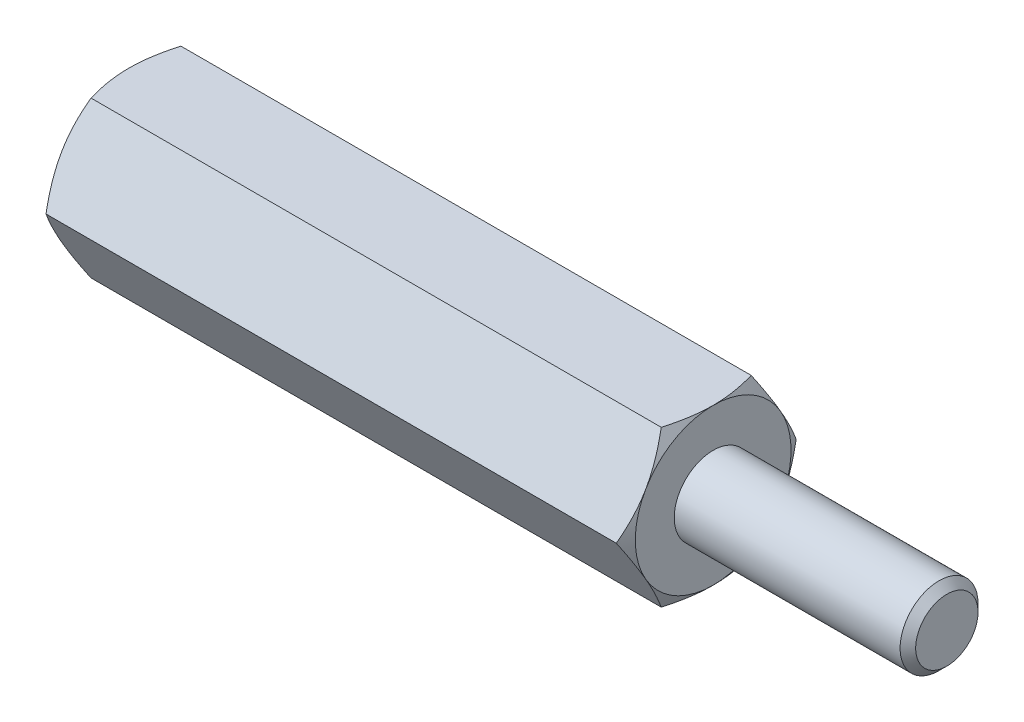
ISO-10303-21;
HEADER;
FILE_DESCRIPTION(('STEP AP214'),'2;1');
FILE_NAME('part.step','',(''),(''),'','','');
FILE_SCHEMA(('AUTOMOTIVE_DESIGN { 1 0 10303 214 1 1 1 1 }'));
ENDSEC;
DATA;
#1=APPLICATION_CONTEXT('core data for automotive mechanical design processes');
#2=APPLICATION_PROTOCOL_DEFINITION('international standard','automotive_design',2000,#1);
#3=PRODUCT_CONTEXT('',#1,'mechanical');
#4=PRODUCT('Part','Part','',(#3));
#5=PRODUCT_RELATED_PRODUCT_CATEGORY('part','',(#4));
#6=PRODUCT_DEFINITION_FORMATION('','',#4);
#7=PRODUCT_DEFINITION_CONTEXT('part definition',#1,'design');
#8=PRODUCT_DEFINITION('design','',#6,#7);
#9=PRODUCT_DEFINITION_SHAPE('','',#8);
#10=(LENGTH_UNIT() NAMED_UNIT(*) SI_UNIT(.MILLI.,.METRE.));
#11=(NAMED_UNIT(*) PLANE_ANGLE_UNIT() SI_UNIT($,.RADIAN.));
#12=(NAMED_UNIT(*) SI_UNIT($,.STERADIAN.) SOLID_ANGLE_UNIT());
#13=UNCERTAINTY_MEASURE_WITH_UNIT(LENGTH_MEASURE(1.E-05),#10,'distance_accuracy_value','');
#14=(GEOMETRIC_REPRESENTATION_CONTEXT(3) GLOBAL_UNCERTAINTY_ASSIGNED_CONTEXT((#13)) GLOBAL_UNIT_ASSIGNED_CONTEXT((#10,
#11,#12)) REPRESENTATION_CONTEXT('',''));
#15=CARTESIAN_POINT('',(0.,0.,0.));
#16=DIRECTION('',(0.,0.,1.));
#17=DIRECTION('',(1.,0.,0.));
#18=AXIS2_PLACEMENT_3D('',#15,#16,#17);
#19=CARTESIAN_POINT('',(7.5,2.,-1.15470053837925));
#20=DIRECTION('',(1.,0.,0.));
#21=DIRECTION('',(0.,0.,-1.));
#22=AXIS2_PLACEMENT_3D('',#19,#20,#21);
#23=PLANE('',#22);
#24=CARTESIAN_POINT('',(7.5,0.,0.));
#25=DIRECTION('',(1.,0.,0.));
#26=DIRECTION('',(0.,0.,-1.));
#27=AXIS2_PLACEMENT_3D('',#24,#25,#26);
#28=CIRCLE('',#27,2.);
#29=CARTESIAN_POINT('',(7.5,-1.,-1.73205080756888));
#30=VERTEX_POINT('',#29);
#31=CARTESIAN_POINT('',(7.5,1.,-1.73205080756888));
#32=VERTEX_POINT('',#31);
#33=EDGE_CURVE('E288',#30,#32,#28,.T.);
#34=ORIENTED_EDGE('',*,*,#33,.T.);
#35=CARTESIAN_POINT('',(7.5,2.,0.));
#36=VERTEX_POINT('',#35);
#37=EDGE_CURVE('E53',#32,#36,#28,.T.);
#38=ORIENTED_EDGE('',*,*,#37,.T.);
#39=CARTESIAN_POINT('',(7.5,1.,1.73205080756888));
#40=VERTEX_POINT('',#39);
#41=EDGE_CURVE('E297',#36,#40,#28,.T.);
#42=ORIENTED_EDGE('',*,*,#41,.T.);
#43=CARTESIAN_POINT('',(7.5,-1.,1.73205080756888));
#44=VERTEX_POINT('',#43);
#45=EDGE_CURVE('E303',#40,#44,#28,.T.);
#46=ORIENTED_EDGE('',*,*,#45,.T.);
#47=CARTESIAN_POINT('',(7.5,0.,0.));
#48=DIRECTION('',(-1.,0.,0.));
#49=DIRECTION('',(0.,-1.,0.));
#50=AXIS2_PLACEMENT_3D('',#47,#48,#49);
#51=CIRCLE('',#50,2.);
#52=CARTESIAN_POINT('',(7.5,-2.,0.));
#53=VERTEX_POINT('',#52);
#54=EDGE_CURVE('E193',#53,#44,#51,.T.);
#55=ORIENTED_EDGE('',*,*,#54,.F.);
#56=EDGE_CURVE('E61',#53,#30,#28,.T.);
#57=ORIENTED_EDGE('',*,*,#56,.T.);
#58=EDGE_LOOP('',(#34,#38,#42,#46,#55,#57));
#59=FACE_BOUND('',#58,.T.);
#60=CARTESIAN_POINT('',(7.5,0.,0.));
#61=DIRECTION('',(1.,0.,0.));
#62=DIRECTION('',(0.,0.,-1.));
#63=AXIS2_PLACEMENT_3D('',#60,#61,#62);
#64=CIRCLE('',#63,1.);
#65=CARTESIAN_POINT('',(7.5,0.,-1.));
#66=VERTEX_POINT('',#65);
#67=EDGE_CURVE('E456',#66,#66,#64,.T.);
#68=ORIENTED_EDGE('',*,*,#67,.F.);
#69=EDGE_LOOP('',(#68));
#70=FACE_BOUND('',#69,.T.);
#71=ADVANCED_FACE('F37',(#59,#70),#23,.T.);
#72=CARTESIAN_POINT('',(7.5,0.,-2.3094010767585));
#73=DIRECTION('',(0.,-0.5,0.866025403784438));
#74=DIRECTION('',(0.,-0.866025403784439,-0.5));
#75=AXIS2_PLACEMENT_3D('',#72,#73,#74);
#76=PLANE('',#75);
#77=CARTESIAN_POINT('',(7.3213005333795,-0.000200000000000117,-2.30951654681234));
#78=CARTESIAN_POINT('',(7.35061046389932,0.0876912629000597,-2.25877250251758));
#79=CARTESIAN_POINT('',(7.37726714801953,0.176341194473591,-2.20759044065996));
#80=CARTESIAN_POINT('',(7.42379750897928,0.355176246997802,-2.10433997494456));
#81=CARTESIAN_POINT('',(7.44365472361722,0.445364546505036,-2.05226973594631));
#82=CARTESIAN_POINT('',(7.47456653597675,0.624623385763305,-1.94877459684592));
#83=CARTESIAN_POINT('',(7.48582684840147,0.713666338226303,-1.89736562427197));
#84=CARTESIAN_POINT('',(7.49927133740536,0.892171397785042,-1.79430568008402));
#85=CARTESIAN_POINT('',(7.50146664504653,0.981632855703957,-1.74265508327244));
#86=CARTESIAN_POINT('',(7.49690901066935,1.1488083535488,-1.64613626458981));
#87=CARTESIAN_POINT('',(7.49127512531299,1.22654737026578,-1.60125362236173));
#88=CARTESIAN_POINT('',(7.47341610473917,1.38151891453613,-1.51178075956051));
#89=CARTESIAN_POINT('',(7.46118486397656,1.4587509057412,-1.46719084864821));
#90=CARTESIAN_POINT('',(7.43060656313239,1.6140421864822,-1.37753338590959));
#91=CARTESIAN_POINT('',(7.41212983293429,1.69208181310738,-1.33247718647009));
#92=CARTESIAN_POINT('',(7.37019448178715,1.84699686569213,-1.24303693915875));
#93=CARTESIAN_POINT('',(7.34674571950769,1.92387427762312,-1.1986517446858));
#94=CARTESIAN_POINT('',(7.3213005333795,2.0002,-1.15458506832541));
#95=B_SPLINE_CURVE_WITH_KNOTS('',3,(#77,#78,#79,#80,#81,#82,#83,#84,#85,#86,#87,#88,#89,#90,#91,
#92,#93,#94),.UNSPECIFIED.,.F.,.F.,(4,2,2,2,2,2,2,2,4),(0.,0.317031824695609,0.634825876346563,
0.944753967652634,1.25430138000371,1.52387047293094,1.79368946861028,2.06949491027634,
2.34475850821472),.UNSPECIFIED.);
#96=CARTESIAN_POINT('',(7.32136720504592,0.,-2.3094010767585));
#97=VERTEX_POINT('',#96);
#98=EDGE_CURVE('E340',#97,#32,#95,.T.);
#99=ORIENTED_EDGE('',*,*,#98,.F.);
#100=DIRECTION('',(-1.,0.,0.));
#101=VECTOR('',#100,1.);
#102=CARTESIAN_POINT('',(7.5,0.,-2.3094010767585));
#103=LINE('',#102,#101);
#104=CARTESIAN_POINT('',(-7.32136720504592,0.,-2.3094010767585));
#105=VERTEX_POINT('',#104);
#106=EDGE_CURVE('E264',#97,#105,#103,.T.);
#107=ORIENTED_EDGE('',*,*,#106,.T.);
#108=CARTESIAN_POINT('',(-7.3213005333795,2.0002,-1.15458506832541));
#109=CARTESIAN_POINT('',(-7.35061046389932,1.91230873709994,-1.20532911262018));
#110=CARTESIAN_POINT('',(-7.37726714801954,1.82365880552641,-1.2565111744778));
#111=CARTESIAN_POINT('',(-7.42379750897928,1.6448237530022,-1.35976164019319));
#112=CARTESIAN_POINT('',(-7.44365472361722,1.55463545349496,-1.41183187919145));
#113=CARTESIAN_POINT('',(-7.47456653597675,1.37537661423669,-1.51532701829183));
#114=CARTESIAN_POINT('',(-7.48582684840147,1.2863336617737,-1.56673599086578));
#115=CARTESIAN_POINT('',(-7.49927133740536,1.10782860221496,-1.66979593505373));
#116=CARTESIAN_POINT('',(-7.50146664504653,1.01836714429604,-1.72144653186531));
#117=CARTESIAN_POINT('',(-7.49690901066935,0.851191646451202,-1.81796535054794));
#118=CARTESIAN_POINT('',(-7.49127512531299,0.773452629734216,-1.86284799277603));
#119=CARTESIAN_POINT('',(-7.47341610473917,0.618481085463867,-1.95232085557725));
#120=CARTESIAN_POINT('',(-7.46118486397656,0.541249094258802,-1.99691076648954));
#121=CARTESIAN_POINT('',(-7.43060656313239,0.385957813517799,-2.08656822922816));
#122=CARTESIAN_POINT('',(-7.41212983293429,0.307918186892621,-2.13162442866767));
#123=CARTESIAN_POINT('',(-7.37019448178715,0.153003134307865,-2.221064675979));
#124=CARTESIAN_POINT('',(-7.34674571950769,0.0761257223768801,-2.26544987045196));
#125=CARTESIAN_POINT('',(-7.3213005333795,-0.000199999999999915,-2.30951654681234));
#126=B_SPLINE_CURVE_WITH_KNOTS('',3,(#108,#109,#110,#111,#112,#113,#114,#115,#116,#117,#118,
#119,#120,#121,#122,#123,#124,#125),.UNSPECIFIED.,.F.,.F.,(4,2,2,2,2,2,2,2,4),(0.,
0.31703182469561,0.634825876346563,0.944753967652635,1.25430138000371,1.52387047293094,
1.79368946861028,2.06949491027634,2.34475850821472),.UNSPECIFIED.);
#127=CARTESIAN_POINT('',(-7.5,1.,-1.73205080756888));
#128=VERTEX_POINT('',#127);
#129=EDGE_CURVE('E379',#128,#105,#126,.T.);
#130=ORIENTED_EDGE('',*,*,#129,.F.);
#131=CARTESIAN_POINT('',(-7.32136720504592,2.,-1.15470053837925));
#132=VERTEX_POINT('',#131);
#133=EDGE_CURVE('E375',#132,#128,#126,.T.);
#134=ORIENTED_EDGE('',*,*,#133,.F.);
#135=DIRECTION('',(-1.,0.,0.));
#136=VECTOR('',#135,1.);
#137=CARTESIAN_POINT('',(7.5,2.,-1.15470053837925));
#138=LINE('',#137,#136);
#139=CARTESIAN_POINT('',(7.321367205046,2.,-1.15470053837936));
#140=VERTEX_POINT('',#139);
#141=EDGE_CURVE('E279',#140,#132,#138,.T.);
#142=ORIENTED_EDGE('',*,*,#141,.F.);
#143=EDGE_CURVE('E229',#32,#140,#95,.T.);
#144=ORIENTED_EDGE('',*,*,#143,.F.);
#145=EDGE_LOOP('',(#99,#107,#130,#134,#142,#144));
#146=FACE_BOUND('',#145,.T.);
#147=ADVANCED_FACE('F148',(#146),#76,.F.);
#148=CARTESIAN_POINT('',(7.5,2.,-1.15470053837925));
#149=DIRECTION('',(0.,-1.,0.));
#150=DIRECTION('',(0.,0.,-1.));
#151=AXIS2_PLACEMENT_3D('',#148,#149,#150);
#152=PLANE('',#151);
#153=CARTESIAN_POINT('',(6.5041453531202,2.,-3.14239762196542));
#154=CARTESIAN_POINT('',(6.54685680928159,2.,-3.05468337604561));
#155=CARTESIAN_POINT('',(6.58917030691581,2.,-2.96677207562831));
#156=CARTESIAN_POINT('',(6.67277831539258,2.,-2.79045070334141));
#157=CARTESIAN_POINT('',(6.71407267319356,2.,-2.70204055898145));
#158=CARTESIAN_POINT('',(6.79561838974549,2.,-2.52418069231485));
#159=CARTESIAN_POINT('',(6.83586319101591,2.,-2.43472795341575));
#160=CARTESIAN_POINT('',(6.91475904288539,2.,-2.25512498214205));
#161=CARTESIAN_POINT('',(6.95341016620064,2.,-2.16497478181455));
#162=CARTESIAN_POINT('',(7.02996617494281,2.,-1.98078525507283));
#163=CARTESIAN_POINT('',(7.06780217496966,2.,-1.88671714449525));
#164=CARTESIAN_POINT('',(7.14070044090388,2.,-1.69751412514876));
#165=CARTESIAN_POINT('',(7.17576294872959,2.,-1.60237931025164));
#166=CARTESIAN_POINT('',(7.24223535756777,2.,-1.41102905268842));
#167=CARTESIAN_POINT('',(7.27365196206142,2.,-1.31481596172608));
#168=CARTESIAN_POINT('',(7.33184764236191,2.,-1.12101028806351));
#169=CARTESIAN_POINT('',(7.3586281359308,2.,-1.02341813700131));
#170=CARTESIAN_POINT('',(7.40615162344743,2.,-0.827336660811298));
#171=CARTESIAN_POINT('',(7.4269281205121,2.,-0.728855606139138));
#172=CARTESIAN_POINT('',(7.46129559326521,2.,-0.530628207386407));
#173=CARTESIAN_POINT('',(7.47488733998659,2.,-0.430882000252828));
#174=CARTESIAN_POINT('',(7.49362159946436,2.,-0.231937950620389));
#175=CARTESIAN_POINT('',(7.49887592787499,2.,-0.132750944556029));
#176=CARTESIAN_POINT('',(7.50079968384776,2.,0.0657049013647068));
#177=CARTESIAN_POINT('',(7.4974689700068,2.,0.164973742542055));
#178=CARTESIAN_POINT('',(7.47965125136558,2.,0.400692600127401));
#179=CARTESIAN_POINT('',(7.46138848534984,2.,0.53685971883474));
#180=CARTESIAN_POINT('',(7.41179958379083,2.,0.806792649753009));
#181=CARTESIAN_POINT('',(7.38046153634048,2.,0.940556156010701));
#182=CARTESIAN_POINT('',(7.30733694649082,2.,1.20849227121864));
#183=CARTESIAN_POINT('',(7.26532316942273,2.,1.34260127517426));
#184=CARTESIAN_POINT('',(7.19701155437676,2.,1.54188460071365));
#185=CARTESIAN_POINT('',(7.17336125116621,2.,1.6079939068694));
#186=CARTESIAN_POINT('',(7.12457310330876,2.,1.73966131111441));
#187=CARTESIAN_POINT('',(7.09943529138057,2.,1.80521942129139));
#188=CARTESIAN_POINT('',(7.03045244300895,2.,1.98014362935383));
#189=CARTESIAN_POINT('',(6.98548288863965,2.,2.08906517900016));
#190=CARTESIAN_POINT('',(6.89293953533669,2.,2.3058004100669));
#191=CARTESIAN_POINT('',(6.84536546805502,2.,2.41361397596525));
#192=CARTESIAN_POINT('',(6.74822629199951,2.,2.62838132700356));
#193=CARTESIAN_POINT('',(6.69866051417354,2.,2.7353348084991));
#194=CARTESIAN_POINT('',(6.59800140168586,2.,2.94852186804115));
#195=CARTESIAN_POINT('',(6.54690802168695,2.,3.05475542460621));
#196=CARTESIAN_POINT('',(6.39169615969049,2.,3.37291303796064));
#197=CARTESIAN_POINT('',(6.28579652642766,2.,3.58396705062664));
#198=CARTESIAN_POINT('',(6.07100981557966,2.,4.00448363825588));
#199=CARTESIAN_POINT('',(5.96212334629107,2.,4.21394652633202));
#200=CARTESIAN_POINT('',(5.75376773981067,2.,4.61000648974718));
#201=CARTESIAN_POINT('',(5.65450073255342,2.,4.79671008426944));
#202=CARTESIAN_POINT('',(5.45476413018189,2.,5.16948614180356));
#203=CARTESIAN_POINT('',(5.35429446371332,2.,5.35555856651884));
#204=CARTESIAN_POINT('',(5.1527937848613,2.,5.72660635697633));
#205=CARTESIAN_POINT('',(5.05176570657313,2.,5.91158331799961));
#206=CARTESIAN_POINT('',(4.84902395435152,2.,6.28114276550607));
#207=CARTESIAN_POINT('',(4.74731033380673,2.,6.46572528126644));
#208=CARTESIAN_POINT('',(4.64534707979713,2.,6.65016883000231));
#209=B_SPLINE_CURVE_WITH_KNOTS('',3,(#153,#154,#155,#156,#157,#158,#159,#160,#161,#162,#163,
#164,#165,#166,#167,#168,#169,#170,#171,#172,#173,#174,#175,#176,#177,#178,#179,#180,#181,#182,
#183,#184,#185,#186,#187,#188,#189,#190,#191,#192,#193,#194,#195,#196,#197,#198,#199,#200,#201,
#202,#203,#204,#205,#206,#207,#208),.UNSPECIFIED.,.F.,.F.,(4,2,2,2,2,2,2,2,2,2,2,2,2,2,2,2,2,2,
2,2,2,2,2,2,2,2,2,4),(0.,0.292684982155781,0.585413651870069,0.879667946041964,1.17390879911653,
1.47805164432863,1.78216793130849,2.08571589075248,2.38917085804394,2.690898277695,
2.99259331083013,3.29020694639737,3.58782548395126,3.99913738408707,4.41082482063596,
4.8321411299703,5.0427662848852,5.25338680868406,5.6068563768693,5.96036243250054,
6.31398824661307,6.66762456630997,7.37597688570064,8.08418599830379,8.71853756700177,
9.3529269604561,9.98522933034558,10.6174830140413),.UNSPECIFIED.);
#210=EDGE_CURVE('E227',#140,#36,#209,.T.);
#211=ORIENTED_EDGE('',*,*,#210,.F.);
#212=ORIENTED_EDGE('',*,*,#141,.T.);
#213=CARTESIAN_POINT('',(-6.5041453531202,2.,-3.14239762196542));
#214=CARTESIAN_POINT('',(-6.54685680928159,2.,-3.05468337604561));
#215=CARTESIAN_POINT('',(-6.58917030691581,2.,-2.96677207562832));
#216=CARTESIAN_POINT('',(-6.67277831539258,2.,-2.79045070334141));
#217=CARTESIAN_POINT('',(-6.71407267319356,2.,-2.70204055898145));
#218=CARTESIAN_POINT('',(-6.79561838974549,2.,-2.52418069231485));
#219=CARTESIAN_POINT('',(-6.83586319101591,2.,-2.43472795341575));
#220=CARTESIAN_POINT('',(-6.91475904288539,2.,-2.25512498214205));
#221=CARTESIAN_POINT('',(-6.95341016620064,2.,-2.16497478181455));
#222=CARTESIAN_POINT('',(-7.02996617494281,2.,-1.98078525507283));
#223=CARTESIAN_POINT('',(-7.06780217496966,2.,-1.88671714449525));
#224=CARTESIAN_POINT('',(-7.14070044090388,2.,-1.69751412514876));
#225=CARTESIAN_POINT('',(-7.17576294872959,2.,-1.60237931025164));
#226=CARTESIAN_POINT('',(-7.24223535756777,2.,-1.41102905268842));
#227=CARTESIAN_POINT('',(-7.27365196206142,2.,-1.31481596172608));
#228=CARTESIAN_POINT('',(-7.33184764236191,2.,-1.12101028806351));
#229=CARTESIAN_POINT('',(-7.3586281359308,2.,-1.02341813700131));
#230=CARTESIAN_POINT('',(-7.40615162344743,2.,-0.827336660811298));
#231=CARTESIAN_POINT('',(-7.4269281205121,2.,-0.728855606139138));
#232=CARTESIAN_POINT('',(-7.46129559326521,2.,-0.530628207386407));
#233=CARTESIAN_POINT('',(-7.47488733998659,2.,-0.430882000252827));
#234=CARTESIAN_POINT('',(-7.49362159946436,2.,-0.231937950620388));
#235=CARTESIAN_POINT('',(-7.49887592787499,2.,-0.132750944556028));
#236=CARTESIAN_POINT('',(-7.50079968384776,2.,0.0657049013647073));
#237=CARTESIAN_POINT('',(-7.4974689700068,2.,0.164973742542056));
#238=CARTESIAN_POINT('',(-7.47965125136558,2.,0.400692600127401));
#239=CARTESIAN_POINT('',(-7.46138848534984,2.,0.53685971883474));
#240=CARTESIAN_POINT('',(-7.41179958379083,2.,0.806792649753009));
#241=CARTESIAN_POINT('',(-7.38046153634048,2.,0.940556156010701));
#242=CARTESIAN_POINT('',(-7.30733694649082,2.,1.20849227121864));
#243=CARTESIAN_POINT('',(-7.26532316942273,2.,1.34260127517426));
#244=CARTESIAN_POINT('',(-7.19701155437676,2.,1.54188460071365));
#245=CARTESIAN_POINT('',(-7.17336125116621,2.,1.6079939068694));
#246=CARTESIAN_POINT('',(-7.12457310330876,2.,1.73966131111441));
#247=CARTESIAN_POINT('',(-7.09943529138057,2.,1.80521942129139));
#248=CARTESIAN_POINT('',(-7.03045244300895,2.,1.98014362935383));
#249=CARTESIAN_POINT('',(-6.98548288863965,2.,2.08906517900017));
#250=CARTESIAN_POINT('',(-6.89293953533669,2.,2.3058004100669));
#251=CARTESIAN_POINT('',(-6.84536546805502,2.,2.41361397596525));
#252=CARTESIAN_POINT('',(-6.74822629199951,2.,2.62838132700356));
#253=CARTESIAN_POINT('',(-6.69866051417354,2.,2.7353348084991));
#254=CARTESIAN_POINT('',(-6.59800140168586,2.,2.94852186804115));
#255=CARTESIAN_POINT('',(-6.54690802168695,2.,3.05475542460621));
#256=CARTESIAN_POINT('',(-6.39169615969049,2.,3.37291303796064));
#257=CARTESIAN_POINT('',(-6.28579652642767,2.,3.58396705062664));
#258=CARTESIAN_POINT('',(-6.07100981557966,2.,4.00448363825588));
#259=CARTESIAN_POINT('',(-5.96212334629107,2.,4.21394652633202));
#260=CARTESIAN_POINT('',(-5.75376773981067,2.,4.61000648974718));
#261=CARTESIAN_POINT('',(-5.65450073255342,2.,4.79671008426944));
#262=CARTESIAN_POINT('',(-5.45476413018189,2.,5.16948614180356));
#263=CARTESIAN_POINT('',(-5.35429446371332,2.,5.35555856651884));
#264=CARTESIAN_POINT('',(-5.1527937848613,2.,5.72660635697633));
#265=CARTESIAN_POINT('',(-5.05176570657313,2.,5.9115833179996));
#266=CARTESIAN_POINT('',(-4.84902395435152,2.,6.28114276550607));
#267=CARTESIAN_POINT('',(-4.74731033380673,2.,6.46572528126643));
#268=CARTESIAN_POINT('',(-4.64534707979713,2.,6.65016883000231));
#269=B_SPLINE_CURVE_WITH_KNOTS('',3,(#213,#214,#215,#216,#217,#218,#219,#220,#221,#222,#223,
#224,#225,#226,#227,#228,#229,#230,#231,#232,#233,#234,#235,#236,#237,#238,#239,#240,#241,#242,
#243,#244,#245,#246,#247,#248,#249,#250,#251,#252,#253,#254,#255,#256,#257,#258,#259,#260,#261,
#262,#263,#264,#265,#266,#267,#268),.UNSPECIFIED.,.F.,.F.,(4,2,2,2,2,2,2,2,2,2,2,2,2,2,2,2,2,2,
2,2,2,2,2,2,2,2,2,4),(0.,0.29268498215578,0.585413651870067,0.879667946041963,1.17390879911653,
1.47805164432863,1.78216793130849,2.08571589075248,2.38917085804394,2.690898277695,
2.99259331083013,3.29020694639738,3.58782548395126,3.99913738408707,4.41082482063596,
4.8321411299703,5.0427662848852,5.25338680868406,5.6068563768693,5.96036243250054,
6.31398824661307,6.66762456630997,7.37597688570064,8.08418599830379,8.71853756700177,
9.3529269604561,9.98522933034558,10.6174830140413),.UNSPECIFIED.);
#270=CARTESIAN_POINT('',(-7.5,2.,0.));
#271=VERTEX_POINT('',#270);
#272=EDGE_CURVE('E241',#271,#132,#269,.F.);
#273=ORIENTED_EDGE('',*,*,#272,.F.);
#274=CARTESIAN_POINT('',(-7.32136720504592,2.,1.15470053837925));
#275=VERTEX_POINT('',#274);
#276=EDGE_CURVE('E249',#275,#271,#269,.F.);
#277=ORIENTED_EDGE('',*,*,#276,.F.);
#278=DIRECTION('',(-1.,0.,0.));
#279=VECTOR('',#278,1.);
#280=CARTESIAN_POINT('',(7.5,2.,1.15470053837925));
#281=LINE('',#280,#279);
#282=CARTESIAN_POINT('',(7.32136720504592,2.,1.15470053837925));
#283=VERTEX_POINT('',#282);
#284=EDGE_CURVE('E276',#283,#275,#281,.T.);
#285=ORIENTED_EDGE('',*,*,#284,.F.);
#286=EDGE_CURVE('E221',#36,#283,#209,.T.);
#287=ORIENTED_EDGE('',*,*,#286,.F.);
#288=EDGE_LOOP('',(#211,#212,#273,#277,#285,#287));
#289=FACE_BOUND('',#288,.T.);
#290=ADVANCED_FACE('F153',(#289),#152,.F.);
#291=CARTESIAN_POINT('',(7.5,2.,1.15470053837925));
#292=DIRECTION('',(0.,-0.5,-0.866025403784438));
#293=DIRECTION('',(0.,0.866025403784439,-0.5));
#294=AXIS2_PLACEMENT_3D('',#291,#292,#293);
#295=PLANE('',#294);
#296=CARTESIAN_POINT('',(7.3213005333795,2.0002,1.15458506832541));
#297=CARTESIAN_POINT('',(7.35061046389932,1.91230873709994,1.20532911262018));
#298=CARTESIAN_POINT('',(7.37726714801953,1.82365880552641,1.2565111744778));
#299=CARTESIAN_POINT('',(7.42379750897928,1.6448237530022,1.35976164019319));
#300=CARTESIAN_POINT('',(7.44365472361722,1.55463545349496,1.41183187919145));
#301=CARTESIAN_POINT('',(7.47456653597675,1.37537661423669,1.51532701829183));
#302=CARTESIAN_POINT('',(7.48582684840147,1.2863336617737,1.56673599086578));
#303=CARTESIAN_POINT('',(7.49927133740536,1.10782860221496,1.66979593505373));
#304=CARTESIAN_POINT('',(7.50146664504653,1.01836714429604,1.72144653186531));
#305=CARTESIAN_POINT('',(7.49690901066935,0.851191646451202,1.81796535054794));
#306=CARTESIAN_POINT('',(7.49127512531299,0.773452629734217,1.86284799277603));
#307=CARTESIAN_POINT('',(7.47341610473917,0.618481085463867,1.95232085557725));
#308=CARTESIAN_POINT('',(7.46118486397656,0.541249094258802,1.99691076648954));
#309=CARTESIAN_POINT('',(7.43060656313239,0.3859578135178,2.08656822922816));
#310=CARTESIAN_POINT('',(7.41212983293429,0.307918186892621,2.13162442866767));
#311=CARTESIAN_POINT('',(7.37019448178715,0.153003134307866,2.221064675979));
#312=CARTESIAN_POINT('',(7.34674571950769,0.0761257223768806,2.26544987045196));
#313=CARTESIAN_POINT('',(7.3213005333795,-0.000199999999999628,2.30951654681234));
#314=B_SPLINE_CURVE_WITH_KNOTS('',3,(#296,#297,#298,#299,#300,#301,#302,#303,#304,#305,#306,
#307,#308,#309,#310,#311,#312,#313),.UNSPECIFIED.,.F.,.F.,(4,2,2,2,2,2,2,2,4),(0.,
0.31703182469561,0.634825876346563,0.944753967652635,1.25430138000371,1.52387047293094,
1.79368946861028,2.06949491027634,2.34475850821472),.UNSPECIFIED.);
#315=EDGE_CURVE('E228',#283,#40,#314,.T.);
#316=ORIENTED_EDGE('',*,*,#315,.F.);
#317=ORIENTED_EDGE('',*,*,#284,.T.);
#318=CARTESIAN_POINT('',(-7.3213005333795,-0.000199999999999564,2.30951654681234));
#319=CARTESIAN_POINT('',(-7.35061046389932,0.0876912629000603,2.25877250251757));
#320=CARTESIAN_POINT('',(-7.37726714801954,0.176341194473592,2.20759044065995));
#321=CARTESIAN_POINT('',(-7.42379750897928,0.355176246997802,2.10433997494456));
#322=CARTESIAN_POINT('',(-7.44365472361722,0.445364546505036,2.0522697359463));
#323=CARTESIAN_POINT('',(-7.47456653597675,0.624623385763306,1.94877459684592));
#324=CARTESIAN_POINT('',(-7.48582684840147,0.713666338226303,1.89736562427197));
#325=CARTESIAN_POINT('',(-7.49927133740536,0.892171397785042,1.79430568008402));
#326=CARTESIAN_POINT('',(-7.50146664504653,0.981632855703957,1.74265508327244));
#327=CARTESIAN_POINT('',(-7.49690901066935,1.1488083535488,1.64613626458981));
#328=CARTESIAN_POINT('',(-7.49127512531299,1.22654737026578,1.60125362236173));
#329=CARTESIAN_POINT('',(-7.47341610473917,1.38151891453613,1.51178075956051));
#330=CARTESIAN_POINT('',(-7.46118486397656,1.4587509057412,1.46719084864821));
#331=CARTESIAN_POINT('',(-7.43060656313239,1.6140421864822,1.37753338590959));
#332=CARTESIAN_POINT('',(-7.41212983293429,1.69208181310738,1.33247718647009));
#333=CARTESIAN_POINT('',(-7.37019448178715,1.84699686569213,1.24303693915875));
#334=CARTESIAN_POINT('',(-7.34674571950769,1.92387427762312,1.1986517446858));
#335=CARTESIAN_POINT('',(-7.3213005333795,2.0002,1.15458506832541));
#336=B_SPLINE_CURVE_WITH_KNOTS('',3,(#318,#319,#320,#321,#322,#323,#324,#325,#326,#327,#328,
#329,#330,#331,#332,#333,#334,#335),.UNSPECIFIED.,.F.,.F.,(4,2,2,2,2,2,2,2,4),(0.,
0.31703182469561,0.634825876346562,0.944753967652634,1.25430138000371,1.52387047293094,
1.79368946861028,2.06949491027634,2.34475850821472),.UNSPECIFIED.);
#337=CARTESIAN_POINT('',(-7.5,1.,1.73205080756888));
#338=VERTEX_POINT('',#337);
#339=EDGE_CURVE('E255',#338,#275,#336,.T.);
#340=ORIENTED_EDGE('',*,*,#339,.F.);
#341=CARTESIAN_POINT('',(-7.32136720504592,0.,2.3094010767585));
#342=VERTEX_POINT('',#341);
#343=EDGE_CURVE('E262',#342,#338,#336,.T.);
#344=ORIENTED_EDGE('',*,*,#343,.F.);
#345=DIRECTION('',(-1.,0.,0.));
#346=VECTOR('',#345,1.);
#347=CARTESIAN_POINT('',(7.5,0.,2.3094010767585));
#348=LINE('',#347,#346);
#349=CARTESIAN_POINT('',(7.32136720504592,0.,2.3094010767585));
#350=VERTEX_POINT('',#349);
#351=EDGE_CURVE('E273',#350,#342,#348,.T.);
#352=ORIENTED_EDGE('',*,*,#351,.F.);
#353=EDGE_CURVE('E215',#40,#350,#314,.T.);
#354=ORIENTED_EDGE('',*,*,#353,.F.);
#355=EDGE_LOOP('',(#316,#317,#340,#344,#352,#354));
#356=FACE_BOUND('',#355,.T.);
#357=ADVANCED_FACE('F235',(#356),#295,.F.);
#358=CARTESIAN_POINT('',(7.5,0.,2.3094010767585));
#359=DIRECTION('',(0.,0.5,-0.866025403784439));
#360=DIRECTION('',(0.,0.866025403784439,0.5));
#361=AXIS2_PLACEMENT_3D('',#358,#359,#360);
#362=PLANE('',#361);
#363=CARTESIAN_POINT('',(7.3213005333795,0.000200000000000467,2.30951654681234));
#364=CARTESIAN_POINT('',(7.35061046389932,-0.0876912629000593,2.25877250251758));
#365=CARTESIAN_POINT('',(7.37726714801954,-0.17634119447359,2.20759044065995));
#366=CARTESIAN_POINT('',(7.42379750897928,-0.355176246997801,2.10433997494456));
#367=CARTESIAN_POINT('',(7.44365472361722,-0.445364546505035,2.0522697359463));
#368=CARTESIAN_POINT('',(7.47456653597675,-0.624623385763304,1.94877459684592));
#369=CARTESIAN_POINT('',(7.48582684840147,-0.713666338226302,1.89736562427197));
#370=CARTESIAN_POINT('',(7.49927133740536,-0.892171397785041,1.79430568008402));
#371=CARTESIAN_POINT('',(7.50146664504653,-0.981632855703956,1.74265508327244));
#372=CARTESIAN_POINT('',(7.49690901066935,-1.1488083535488,1.64613626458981));
#373=CARTESIAN_POINT('',(7.49127512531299,-1.22654737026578,1.60125362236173));
#374=CARTESIAN_POINT('',(7.47341610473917,-1.38151891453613,1.51178075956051));
#375=CARTESIAN_POINT('',(7.46118486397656,-1.4587509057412,1.46719084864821));
#376=CARTESIAN_POINT('',(7.43060656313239,-1.6140421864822,1.37753338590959));
#377=CARTESIAN_POINT('',(7.41212983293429,-1.69208181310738,1.33247718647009));
#378=CARTESIAN_POINT('',(7.37019448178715,-1.84699686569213,1.24303693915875));
#379=CARTESIAN_POINT('',(7.34674571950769,-1.92387427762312,1.1986517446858));
#380=CARTESIAN_POINT('',(7.3213005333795,-2.0002,1.15458506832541));
#381=B_SPLINE_CURVE_WITH_KNOTS('',3,(#363,#364,#365,#366,#367,#368,#369,#370,#371,#372,#373,
#374,#375,#376,#377,#378,#379,#380),.UNSPECIFIED.,.F.,.F.,(4,2,2,2,2,2,2,2,4),(0.,
0.317031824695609,0.634825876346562,0.944753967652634,1.25430138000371,1.52387047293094,
1.79368946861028,2.06949491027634,2.34475850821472),.UNSPECIFIED.);
#382=EDGE_CURVE('E319',#350,#44,#381,.T.);
#383=ORIENTED_EDGE('',*,*,#382,.F.);
#384=ORIENTED_EDGE('',*,*,#351,.T.);
#385=CARTESIAN_POINT('',(-7.3213005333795,-2.0002,1.15458506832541));
#386=CARTESIAN_POINT('',(-7.35061046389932,-1.91230873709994,1.20532911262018));
#387=CARTESIAN_POINT('',(-7.37726714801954,-1.82365880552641,1.2565111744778));
#388=CARTESIAN_POINT('',(-7.42379750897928,-1.6448237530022,1.35976164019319));
#389=CARTESIAN_POINT('',(-7.44365472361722,-1.55463545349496,1.41183187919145));
#390=CARTESIAN_POINT('',(-7.47456653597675,-1.3753766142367,1.51532701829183));
#391=CARTESIAN_POINT('',(-7.48582684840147,-1.2863336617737,1.56673599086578));
#392=CARTESIAN_POINT('',(-7.49927133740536,-1.10782860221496,1.66979593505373));
#393=CARTESIAN_POINT('',(-7.50146664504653,-1.01836714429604,1.72144653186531));
#394=CARTESIAN_POINT('',(-7.49690901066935,-0.851191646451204,1.81796535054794));
#395=CARTESIAN_POINT('',(-7.49127512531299,-0.773452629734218,1.86284799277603));
#396=CARTESIAN_POINT('',(-7.47341610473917,-0.618481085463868,1.95232085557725));
#397=CARTESIAN_POINT('',(-7.46118486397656,-0.541249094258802,1.99691076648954));
#398=CARTESIAN_POINT('',(-7.43060656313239,-0.3859578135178,2.08656822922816));
#399=CARTESIAN_POINT('',(-7.41212983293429,-0.307918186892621,2.13162442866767));
#400=CARTESIAN_POINT('',(-7.37019448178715,-0.153003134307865,2.221064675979));
#401=CARTESIAN_POINT('',(-7.34674571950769,-0.0761257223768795,2.26544987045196));
#402=CARTESIAN_POINT('',(-7.3213005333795,0.000200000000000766,2.30951654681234));
#403=B_SPLINE_CURVE_WITH_KNOTS('',3,(#385,#386,#387,#388,#389,#390,#391,#392,#393,#394,#395,
#396,#397,#398,#399,#400,#401,#402),.UNSPECIFIED.,.F.,.F.,(4,2,2,2,2,2,2,2,4),(0.,
0.317031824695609,0.634825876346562,0.944753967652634,1.25430138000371,1.52387047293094,
1.79368946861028,2.06949491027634,2.34475850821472),.UNSPECIFIED.);
#404=CARTESIAN_POINT('',(-7.5,-1.,1.73205080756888));
#405=VERTEX_POINT('',#404);
#406=EDGE_CURVE('E263',#405,#342,#403,.T.);
#407=ORIENTED_EDGE('',*,*,#406,.F.);
#408=CARTESIAN_POINT('',(-7.32136720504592,-2.,1.15470053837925));
#409=VERTEX_POINT('',#408);
#410=EDGE_CURVE('E250',#409,#405,#403,.T.);
#411=ORIENTED_EDGE('',*,*,#410,.F.);
#412=DIRECTION('',(-1.,0.,0.));
#413=VECTOR('',#412,1.);
#414=CARTESIAN_POINT('',(7.5,-2.,1.15470053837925));
#415=LINE('',#414,#413);
#416=CARTESIAN_POINT('',(7.32136720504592,-2.,1.15470053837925));
#417=VERTEX_POINT('',#416);
#418=EDGE_CURVE('E270',#417,#409,#415,.T.);
#419=ORIENTED_EDGE('',*,*,#418,.F.);
#420=EDGE_CURVE('E210',#44,#417,#381,.T.);
#421=ORIENTED_EDGE('',*,*,#420,.F.);
#422=EDGE_LOOP('',(#383,#384,#407,#411,#419,#421));
#423=FACE_BOUND('',#422,.T.);
#424=ADVANCED_FACE('F318',(#423),#362,.F.);
#425=CARTESIAN_POINT('',(7.5,-2.,1.15470053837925));
#426=DIRECTION('',(0.,1.,0.));
#427=DIRECTION('',(0.,0.,1.));
#428=AXIS2_PLACEMENT_3D('',#425,#426,#427);
#429=PLANE('',#428);
#430=CARTESIAN_POINT('',(6.5041453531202,-2.,-3.14239762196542));
#431=CARTESIAN_POINT('',(6.54685680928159,-2.,-3.05468337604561));
#432=CARTESIAN_POINT('',(6.58917030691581,-2.,-2.96677207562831));
#433=CARTESIAN_POINT('',(6.67277831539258,-2.,-2.79045070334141));
#434=CARTESIAN_POINT('',(6.71407267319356,-2.,-2.70204055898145));
#435=CARTESIAN_POINT('',(6.79561838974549,-2.,-2.52418069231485));
#436=CARTESIAN_POINT('',(6.83586319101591,-2.,-2.43472795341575));
#437=CARTESIAN_POINT('',(6.91475904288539,-2.,-2.25512498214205));
#438=CARTESIAN_POINT('',(6.95341016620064,-2.,-2.16497478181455));
#439=CARTESIAN_POINT('',(7.02996617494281,-2.,-1.98078525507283));
#440=CARTESIAN_POINT('',(7.06780217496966,-2.,-1.88671714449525));
#441=CARTESIAN_POINT('',(7.14070044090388,-2.,-1.69751412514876));
#442=CARTESIAN_POINT('',(7.17576294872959,-2.,-1.60237931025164));
#443=CARTESIAN_POINT('',(7.24223535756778,-2.,-1.41102905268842));
#444=CARTESIAN_POINT('',(7.27365196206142,-2.,-1.31481596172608));
#445=CARTESIAN_POINT('',(7.33184764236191,-2.,-1.12101028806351));
#446=CARTESIAN_POINT('',(7.3586281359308,-2.,-1.02341813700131));
#447=CARTESIAN_POINT('',(7.40615162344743,-2.,-0.827336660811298));
#448=CARTESIAN_POINT('',(7.4269281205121,-2.,-0.728855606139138));
#449=CARTESIAN_POINT('',(7.46129559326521,-2.,-0.530628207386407));
#450=CARTESIAN_POINT('',(7.47488733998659,-2.,-0.430882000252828));
#451=CARTESIAN_POINT('',(7.49362159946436,-2.,-0.231937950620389));
#452=CARTESIAN_POINT('',(7.49887592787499,-2.,-0.132750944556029));
#453=CARTESIAN_POINT('',(7.50079968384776,-2.,0.0657049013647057));
#454=CARTESIAN_POINT('',(7.4974689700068,-2.,0.164973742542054));
#455=CARTESIAN_POINT('',(7.47965125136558,-2.,0.400692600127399));
#456=CARTESIAN_POINT('',(7.46138848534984,-2.,0.536859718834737));
#457=CARTESIAN_POINT('',(7.41179958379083,-2.,0.806792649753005));
#458=CARTESIAN_POINT('',(7.38046153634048,-2.,0.940556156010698));
#459=CARTESIAN_POINT('',(7.30733694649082,-2.,1.20849227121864));
#460=CARTESIAN_POINT('',(7.26532316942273,-2.,1.34260127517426));
#461=CARTESIAN_POINT('',(7.19701155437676,-2.,1.54188460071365));
#462=CARTESIAN_POINT('',(7.17336125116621,-2.,1.60799390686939));
#463=CARTESIAN_POINT('',(7.12457310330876,-2.,1.7396613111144));
#464=CARTESIAN_POINT('',(7.09943529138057,-2.,1.80521942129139));
#465=CARTESIAN_POINT('',(7.03045244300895,-2.,1.98014362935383));
#466=CARTESIAN_POINT('',(6.98548288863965,-2.,2.08906517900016));
#467=CARTESIAN_POINT('',(6.8929395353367,-2.,2.3058004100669));
#468=CARTESIAN_POINT('',(6.84536546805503,-2.,2.41361397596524));
#469=CARTESIAN_POINT('',(6.74822629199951,-2.,2.62838132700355));
#470=CARTESIAN_POINT('',(6.69866051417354,-2.,2.7353348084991));
#471=CARTESIAN_POINT('',(6.59800140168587,-2.,2.94852186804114));
#472=CARTESIAN_POINT('',(6.54690802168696,-2.,3.05475542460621));
#473=CARTESIAN_POINT('',(6.39169615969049,-2.,3.37291303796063));
#474=CARTESIAN_POINT('',(6.28579652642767,-2.,3.58396705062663));
#475=CARTESIAN_POINT('',(6.07100981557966,-2.,4.00448363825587));
#476=CARTESIAN_POINT('',(5.96212334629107,-2.,4.21394652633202));
#477=CARTESIAN_POINT('',(5.75376773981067,-2.,4.61000648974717));
#478=CARTESIAN_POINT('',(5.65450073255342,-2.,4.79671008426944));
#479=CARTESIAN_POINT('',(5.4547641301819,-2.,5.16948614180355));
#480=CARTESIAN_POINT('',(5.35429446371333,-2.,5.35555856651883));
#481=CARTESIAN_POINT('',(5.1527937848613,-2.,5.72660635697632));
#482=CARTESIAN_POINT('',(5.05176570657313,-2.,5.9115833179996));
#483=CARTESIAN_POINT('',(4.84902395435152,-2.,6.28114276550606));
#484=CARTESIAN_POINT('',(4.74731033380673,-2.,6.46572528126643));
#485=CARTESIAN_POINT('',(4.64534707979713,-2.,6.6501688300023));
#486=B_SPLINE_CURVE_WITH_KNOTS('',3,(#430,#431,#432,#433,#434,#435,#436,#437,#438,#439,#440,
#441,#442,#443,#444,#445,#446,#447,#448,#449,#450,#451,#452,#453,#454,#455,#456,#457,#458,#459,
#460,#461,#462,#463,#464,#465,#466,#467,#468,#469,#470,#471,#472,#473,#474,#475,#476,#477,#478,
#479,#480,#481,#482,#483,#484,#485),.UNSPECIFIED.,.F.,.F.,(4,2,2,2,2,2,2,2,2,2,2,2,2,2,2,2,2,2,
2,2,2,2,2,2,2,2,2,4),(0.,0.292684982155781,0.585413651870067,0.879667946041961,1.17390879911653,
1.47805164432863,1.78216793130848,2.08571589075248,2.38917085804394,2.690898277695,
2.99259331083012,3.29020694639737,3.58782548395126,3.99913738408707,4.41082482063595,
4.83214112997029,5.04276628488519,5.25338680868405,5.60685637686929,5.96036243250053,
6.31398824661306,6.66762456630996,7.37597688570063,8.08418599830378,8.71853756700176,
9.35292696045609,9.98522933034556,10.6174830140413),.UNSPECIFIED.);
#487=EDGE_CURVE('E325',#417,#53,#486,.F.);
#488=ORIENTED_EDGE('',*,*,#487,.F.);
#489=ORIENTED_EDGE('',*,*,#418,.T.);
#490=CARTESIAN_POINT('',(-6.5041453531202,-2.,-3.14239762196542));
#491=CARTESIAN_POINT('',(-6.54685680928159,-2.,-3.05468337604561));
#492=CARTESIAN_POINT('',(-6.58917030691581,-2.,-2.96677207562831));
#493=CARTESIAN_POINT('',(-6.67277831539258,-2.,-2.79045070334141));
#494=CARTESIAN_POINT('',(-6.71407267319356,-2.,-2.70204055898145));
#495=CARTESIAN_POINT('',(-6.79561838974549,-2.,-2.52418069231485));
#496=CARTESIAN_POINT('',(-6.83586319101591,-2.,-2.43472795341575));
#497=CARTESIAN_POINT('',(-6.91475904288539,-2.,-2.25512498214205));
#498=CARTESIAN_POINT('',(-6.95341016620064,-2.,-2.16497478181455));
#499=CARTESIAN_POINT('',(-7.02996617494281,-2.,-1.98078525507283));
#500=CARTESIAN_POINT('',(-7.06780217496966,-2.,-1.88671714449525));
#501=CARTESIAN_POINT('',(-7.14070044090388,-2.,-1.69751412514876));
#502=CARTESIAN_POINT('',(-7.17576294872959,-2.,-1.60237931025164));
#503=CARTESIAN_POINT('',(-7.24223535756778,-2.,-1.41102905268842));
#504=CARTESIAN_POINT('',(-7.27365196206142,-2.,-1.31481596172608));
#505=CARTESIAN_POINT('',(-7.33184764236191,-2.,-1.12101028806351));
#506=CARTESIAN_POINT('',(-7.3586281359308,-2.,-1.02341813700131));
#507=CARTESIAN_POINT('',(-7.40615162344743,-2.,-0.827336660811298));
#508=CARTESIAN_POINT('',(-7.4269281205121,-2.,-0.728855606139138));
#509=CARTESIAN_POINT('',(-7.46129559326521,-2.,-0.530628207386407));
#510=CARTESIAN_POINT('',(-7.47488733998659,-2.,-0.430882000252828));
#511=CARTESIAN_POINT('',(-7.49362159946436,-2.,-0.231937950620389));
#512=CARTESIAN_POINT('',(-7.49887592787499,-2.,-0.132750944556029));
#513=CARTESIAN_POINT('',(-7.50079968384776,-2.,0.0657049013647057));
#514=CARTESIAN_POINT('',(-7.4974689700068,-2.,0.164973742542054));
#515=CARTESIAN_POINT('',(-7.47965125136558,-2.,0.400692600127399));
#516=CARTESIAN_POINT('',(-7.46138848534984,-2.,0.536859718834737));
#517=CARTESIAN_POINT('',(-7.41179958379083,-2.,0.806792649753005));
#518=CARTESIAN_POINT('',(-7.38046153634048,-2.,0.940556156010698));
#519=CARTESIAN_POINT('',(-7.30733694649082,-2.,1.20849227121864));
#520=CARTESIAN_POINT('',(-7.26532316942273,-2.,1.34260127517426));
#521=CARTESIAN_POINT('',(-7.19701155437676,-2.,1.54188460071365));
#522=CARTESIAN_POINT('',(-7.17336125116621,-2.,1.60799390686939));
#523=CARTESIAN_POINT('',(-7.12457310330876,-2.,1.7396613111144));
#524=CARTESIAN_POINT('',(-7.09943529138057,-2.,1.80521942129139));
#525=CARTESIAN_POINT('',(-7.03045244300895,-2.,1.98014362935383));
#526=CARTESIAN_POINT('',(-6.98548288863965,-2.,2.08906517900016));
#527=CARTESIAN_POINT('',(-6.8929395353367,-2.,2.30580041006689));
#528=CARTESIAN_POINT('',(-6.84536546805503,-2.,2.41361397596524));
#529=CARTESIAN_POINT('',(-6.74822629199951,-2.,2.62838132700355));
#530=CARTESIAN_POINT('',(-6.69866051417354,-2.,2.7353348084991));
#531=CARTESIAN_POINT('',(-6.59800140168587,-2.,2.94852186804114));
#532=CARTESIAN_POINT('',(-6.54690802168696,-2.,3.05475542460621));
#533=CARTESIAN_POINT('',(-6.39169615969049,-2.,3.37291303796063));
#534=CARTESIAN_POINT('',(-6.28579652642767,-2.,3.58396705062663));
#535=CARTESIAN_POINT('',(-6.07100981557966,-2.,4.00448363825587));
#536=CARTESIAN_POINT('',(-5.96212334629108,-2.,4.21394652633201));
#537=CARTESIAN_POINT('',(-5.75376773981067,-2.,4.61000648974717));
#538=CARTESIAN_POINT('',(-5.65450073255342,-2.,4.79671008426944));
#539=CARTESIAN_POINT('',(-5.4547641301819,-2.,5.16948614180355));
#540=CARTESIAN_POINT('',(-5.35429446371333,-2.,5.35555856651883));
#541=CARTESIAN_POINT('',(-5.1527937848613,-2.,5.72660635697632));
#542=CARTESIAN_POINT('',(-5.05176570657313,-2.,5.9115833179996));
#543=CARTESIAN_POINT('',(-4.84902395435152,-2.,6.28114276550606));
#544=CARTESIAN_POINT('',(-4.74731033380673,-2.,6.46572528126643));
#545=CARTESIAN_POINT('',(-4.64534707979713,-2.,6.6501688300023));
#546=B_SPLINE_CURVE_WITH_KNOTS('',3,(#490,#491,#492,#493,#494,#495,#496,#497,#498,#499,#500,
#501,#502,#503,#504,#505,#506,#507,#508,#509,#510,#511,#512,#513,#514,#515,#516,#517,#518,#519,
#520,#521,#522,#523,#524,#525,#526,#527,#528,#529,#530,#531,#532,#533,#534,#535,#536,#537,#538,
#539,#540,#541,#542,#543,#544,#545),.UNSPECIFIED.,.F.,.F.,(4,2,2,2,2,2,2,2,2,2,2,2,2,2,2,2,2,2,
2,2,2,2,2,2,2,2,2,4),(0.,0.292684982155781,0.585413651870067,0.879667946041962,1.17390879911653,
1.47805164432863,1.78216793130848,2.08571589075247,2.38917085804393,2.690898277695,
2.99259331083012,3.29020694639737,3.58782548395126,3.99913738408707,4.41082482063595,
4.83214112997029,5.04276628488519,5.25338680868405,5.60685637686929,5.96036243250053,
6.31398824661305,6.66762456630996,7.37597688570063,8.08418599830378,8.71853756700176,
9.35292696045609,9.98522933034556,10.6174830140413),.UNSPECIFIED.);
#547=CARTESIAN_POINT('',(-7.5,-2.,0.));
#548=VERTEX_POINT('',#547);
#549=EDGE_CURVE('E371',#548,#409,#546,.T.);
#550=ORIENTED_EDGE('',*,*,#549,.F.);
#551=CARTESIAN_POINT('',(-7.32136720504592,-2.,-1.15470053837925));
#552=VERTEX_POINT('',#551);
#553=EDGE_CURVE('E376',#552,#548,#546,.T.);
#554=ORIENTED_EDGE('',*,*,#553,.F.);
#555=DIRECTION('',(-1.,0.,0.));
#556=VECTOR('',#555,1.);
#557=CARTESIAN_POINT('',(7.5,-2.,-1.15470053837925));
#558=LINE('',#557,#556);
#559=CARTESIAN_POINT('',(7.32136720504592,-2.,-1.15470053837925));
#560=VERTEX_POINT('',#559);
#561=EDGE_CURVE('E267',#560,#552,#558,.T.);
#562=ORIENTED_EDGE('',*,*,#561,.F.);
#563=EDGE_CURVE('E195',#53,#560,#486,.F.);
#564=ORIENTED_EDGE('',*,*,#563,.F.);
#565=EDGE_LOOP('',(#488,#489,#550,#554,#562,#564));
#566=FACE_BOUND('',#565,.T.);
#567=ADVANCED_FACE('F172',(#566),#429,.F.);
#568=CARTESIAN_POINT('',(7.5,-2.,-1.15470053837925));
#569=DIRECTION('',(0.,0.5,0.866025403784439));
#570=DIRECTION('',(0.,-0.866025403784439,0.5));
#571=AXIS2_PLACEMENT_3D('',#568,#569,#570);
#572=PLANE('',#571);
#573=CARTESIAN_POINT('',(7.3213005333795,-2.0002,-1.15458506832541));
#574=CARTESIAN_POINT('',(7.35061046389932,-1.91230873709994,-1.20532911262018));
#575=CARTESIAN_POINT('',(7.37726714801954,-1.82365880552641,-1.2565111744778));
#576=CARTESIAN_POINT('',(7.42379750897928,-1.6448237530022,-1.35976164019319));
#577=CARTESIAN_POINT('',(7.44365472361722,-1.55463545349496,-1.41183187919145));
#578=CARTESIAN_POINT('',(7.47456653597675,-1.3753766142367,-1.51532701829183));
#579=CARTESIAN_POINT('',(7.48582684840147,-1.2863336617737,-1.56673599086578));
#580=CARTESIAN_POINT('',(7.49927133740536,-1.10782860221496,-1.66979593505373));
#581=CARTESIAN_POINT('',(7.50146664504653,-1.01836714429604,-1.72144653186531));
#582=CARTESIAN_POINT('',(7.49690901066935,-0.851191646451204,-1.81796535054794));
#583=CARTESIAN_POINT('',(7.49127512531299,-0.773452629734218,-1.86284799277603));
#584=CARTESIAN_POINT('',(7.47341610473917,-0.618481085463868,-1.95232085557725));
#585=CARTESIAN_POINT('',(7.46118486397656,-0.541249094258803,-1.99691076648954));
#586=CARTESIAN_POINT('',(7.43060656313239,-0.3859578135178,-2.08656822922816));
#587=CARTESIAN_POINT('',(7.41212983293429,-0.307918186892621,-2.13162442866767));
#588=CARTESIAN_POINT('',(7.37019448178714,-0.153003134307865,-2.221064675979));
#589=CARTESIAN_POINT('',(7.34674571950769,-0.07612572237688,-2.26544987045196));
#590=CARTESIAN_POINT('',(7.3213005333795,0.00020000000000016,-2.30951654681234));
#591=B_SPLINE_CURVE_WITH_KNOTS('',3,(#573,#574,#575,#576,#577,#578,#579,#580,#581,#582,#583,
#584,#585,#586,#587,#588,#589,#590),.UNSPECIFIED.,.F.,.F.,(4,2,2,2,2,2,2,2,4),(0.,
0.317031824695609,0.634825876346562,0.944753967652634,1.25430138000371,1.52387047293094,
1.79368946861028,2.06949491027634,2.34475850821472),.UNSPECIFIED.);
#592=EDGE_CURVE('E192',#560,#30,#591,.T.);
#593=ORIENTED_EDGE('',*,*,#592,.F.);
#594=ORIENTED_EDGE('',*,*,#561,.T.);
#595=CARTESIAN_POINT('',(-7.3213005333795,0.000199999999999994,-2.30951654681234));
#596=CARTESIAN_POINT('',(-7.35061046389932,-0.08769126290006,-2.25877250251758));
#597=CARTESIAN_POINT('',(-7.37726714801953,-0.176341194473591,-2.20759044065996));
#598=CARTESIAN_POINT('',(-7.42379750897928,-0.355176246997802,-2.10433997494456));
#599=CARTESIAN_POINT('',(-7.44365472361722,-0.445364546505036,-2.05226973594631));
#600=CARTESIAN_POINT('',(-7.47456653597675,-0.624623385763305,-1.94877459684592));
#601=CARTESIAN_POINT('',(-7.48582684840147,-0.713666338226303,-1.89736562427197));
#602=CARTESIAN_POINT('',(-7.49927133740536,-0.892171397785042,-1.79430568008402));
#603=CARTESIAN_POINT('',(-7.50146664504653,-0.981632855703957,-1.74265508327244));
#604=CARTESIAN_POINT('',(-7.49690901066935,-1.1488083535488,-1.64613626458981));
#605=CARTESIAN_POINT('',(-7.49127512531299,-1.22654737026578,-1.60125362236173));
#606=CARTESIAN_POINT('',(-7.47341610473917,-1.38151891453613,-1.51178075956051));
#607=CARTESIAN_POINT('',(-7.46118486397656,-1.4587509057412,-1.46719084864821));
#608=CARTESIAN_POINT('',(-7.43060656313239,-1.6140421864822,-1.37753338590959));
#609=CARTESIAN_POINT('',(-7.41212983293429,-1.69208181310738,-1.33247718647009));
#610=CARTESIAN_POINT('',(-7.37019448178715,-1.84699686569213,-1.24303693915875));
#611=CARTESIAN_POINT('',(-7.34674571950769,-1.92387427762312,-1.1986517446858));
#612=CARTESIAN_POINT('',(-7.3213005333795,-2.0002,-1.15458506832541));
#613=B_SPLINE_CURVE_WITH_KNOTS('',3,(#595,#596,#597,#598,#599,#600,#601,#602,#603,#604,#605,
#606,#607,#608,#609,#610,#611,#612),.UNSPECIFIED.,.F.,.F.,(4,2,2,2,2,2,2,2,4),(0.,
0.317031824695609,0.634825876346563,0.944753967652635,1.25430138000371,1.52387047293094,
1.79368946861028,2.06949491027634,2.34475850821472),.UNSPECIFIED.);
#614=CARTESIAN_POINT('',(-7.5,-1.,-1.73205080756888));
#615=VERTEX_POINT('',#614);
#616=EDGE_CURVE('E178',#615,#552,#613,.T.);
#617=ORIENTED_EDGE('',*,*,#616,.F.);
#618=EDGE_CURVE('E383',#105,#615,#613,.T.);
#619=ORIENTED_EDGE('',*,*,#618,.F.);
#620=ORIENTED_EDGE('',*,*,#106,.F.);
#621=EDGE_CURVE('E185',#30,#97,#591,.T.);
#622=ORIENTED_EDGE('',*,*,#621,.F.);
#623=EDGE_LOOP('',(#593,#594,#617,#619,#620,#622));
#624=FACE_BOUND('',#623,.T.);
#625=ADVANCED_FACE('F167',(#624),#572,.F.);
#626=CARTESIAN_POINT('',(-7.5,0.,0.));
#627=DIRECTION('',(1.,0.,0.));
#628=DIRECTION('',(0.,1.,0.));
#629=AXIS2_PLACEMENT_3D('',#626,#627,#628);
#630=CONICAL_SURFACE('',#629,2.,1.0471975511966);
#631=ORIENTED_EDGE('',*,*,#129,.T.);
#632=ORIENTED_EDGE('',*,*,#618,.T.);
#633=CARTESIAN_POINT('',(-7.5,0.,0.));
#634=DIRECTION('',(1.,0.,0.));
#635=DIRECTION('',(0.,0.,-1.));
#636=AXIS2_PLACEMENT_3D('',#633,#634,#635);
#637=CIRCLE('',#636,2.);
#638=EDGE_CURVE('E282',#615,#128,#637,.T.);
#639=ORIENTED_EDGE('',*,*,#638,.T.);
#640=EDGE_LOOP('',(#631,#632,#639));
#641=FACE_BOUND('',#640,.T.);
#642=ADVANCED_FACE('F171',(#641),#630,.T.);
#643=ORIENTED_EDGE('',*,*,#553,.T.);
#644=EDGE_CURVE('E286',#548,#615,#637,.T.);
#645=ORIENTED_EDGE('',*,*,#644,.T.);
#646=ORIENTED_EDGE('',*,*,#616,.T.);
#647=EDGE_LOOP('',(#643,#645,#646));
#648=FACE_BOUND('',#647,.T.);
#649=ADVANCED_FACE('F393',(#648),#630,.T.);
#650=ORIENTED_EDGE('',*,*,#410,.T.);
#651=CARTESIAN_POINT('',(-7.5,0.,0.));
#652=DIRECTION('',(-1.,0.,0.));
#653=DIRECTION('',(0.,-1.,0.));
#654=AXIS2_PLACEMENT_3D('',#651,#652,#653);
#655=CIRCLE('',#654,2.);
#656=EDGE_CURVE('E346',#548,#405,#655,.T.);
#657=ORIENTED_EDGE('',*,*,#656,.F.);
#658=ORIENTED_EDGE('',*,*,#549,.T.);
#659=EDGE_LOOP('',(#650,#657,#658));
#660=FACE_BOUND('',#659,.T.);
#661=ADVANCED_FACE('F488',(#660),#630,.T.);
#662=ORIENTED_EDGE('',*,*,#343,.T.);
#663=EDGE_CURVE('E368',#338,#405,#637,.T.);
#664=ORIENTED_EDGE('',*,*,#663,.T.);
#665=ORIENTED_EDGE('',*,*,#406,.T.);
#666=EDGE_LOOP('',(#662,#664,#665));
#667=FACE_BOUND('',#666,.T.);
#668=ADVANCED_FACE('F158',(#667),#630,.T.);
#669=ORIENTED_EDGE('',*,*,#339,.T.);
#670=ORIENTED_EDGE('',*,*,#276,.T.);
#671=EDGE_CURVE('E614',#271,#338,#637,.T.);
#672=ORIENTED_EDGE('',*,*,#671,.T.);
#673=EDGE_LOOP('',(#669,#670,#672));
#674=FACE_BOUND('',#673,.T.);
#675=ADVANCED_FACE('F486',(#674),#630,.T.);
#676=ORIENTED_EDGE('',*,*,#272,.T.);
#677=ORIENTED_EDGE('',*,*,#133,.T.);
#678=EDGE_CURVE('E287',#128,#271,#637,.T.);
#679=ORIENTED_EDGE('',*,*,#678,.T.);
#680=EDGE_LOOP('',(#676,#677,#679));
#681=FACE_BOUND('',#680,.T.);
#682=ADVANCED_FACE('F165',(#681),#630,.T.);
#683=CARTESIAN_POINT('',(-7.5,2.,-1.15470053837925));
#684=DIRECTION('',(1.,0.,0.));
#685=DIRECTION('',(0.,0.,-1.));
#686=AXIS2_PLACEMENT_3D('',#683,#684,#685);
#687=PLANE('',#686);
#688=CARTESIAN_POINT('',(-7.5,0.,0.));
#689=DIRECTION('',(-1.,0.,0.));
#690=DIRECTION('',(0.,0.,1.));
#691=AXIS2_PLACEMENT_3D('',#688,#689,#690);
#692=CIRCLE('',#691,0.8);
#693=CARTESIAN_POINT('',(-7.5,0.,0.8));
#694=VERTEX_POINT('',#693);
#695=EDGE_CURVE('E460',#694,#694,#692,.T.);
#696=ORIENTED_EDGE('',*,*,#695,.F.);
#697=EDGE_LOOP('',(#696));
#698=FACE_BOUND('',#697,.T.);
#699=ORIENTED_EDGE('',*,*,#678,.F.);
#700=ORIENTED_EDGE('',*,*,#638,.F.);
#701=ORIENTED_EDGE('',*,*,#644,.F.);
#702=ORIENTED_EDGE('',*,*,#656,.T.);
#703=ORIENTED_EDGE('',*,*,#663,.F.);
#704=ORIENTED_EDGE('',*,*,#671,.F.);
#705=EDGE_LOOP('',(#699,#700,#701,#702,#703,#704));
#706=FACE_BOUND('',#705,.T.);
#707=ADVANCED_FACE('F161',(#698,#706),#687,.F.);
#708=CARTESIAN_POINT('',(7.5,0.,0.));
#709=DIRECTION('',(-1.,0.,0.));
#710=DIRECTION('',(0.,1.,0.));
#711=AXIS2_PLACEMENT_3D('',#708,#709,#710);
#712=CONICAL_SURFACE('',#711,2.,1.0471975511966);
#713=ORIENTED_EDGE('',*,*,#98,.T.);
#714=ORIENTED_EDGE('',*,*,#33,.F.);
#715=ORIENTED_EDGE('',*,*,#621,.T.);
#716=EDGE_LOOP('',(#713,#714,#715));
#717=FACE_BOUND('',#716,.T.);
#718=ADVANCED_FACE('F164',(#717),#712,.T.);
#719=ORIENTED_EDGE('',*,*,#563,.T.);
#720=ORIENTED_EDGE('',*,*,#592,.T.);
#721=ORIENTED_EDGE('',*,*,#56,.F.);
#722=EDGE_LOOP('',(#719,#720,#721));
#723=FACE_BOUND('',#722,.T.);
#724=ADVANCED_FACE('F202',(#723),#712,.T.);
#725=ORIENTED_EDGE('',*,*,#420,.T.);
#726=ORIENTED_EDGE('',*,*,#487,.T.);
#727=ORIENTED_EDGE('',*,*,#54,.T.);
#728=EDGE_LOOP('',(#725,#726,#727));
#729=FACE_BOUND('',#728,.T.);
#730=ADVANCED_FACE('F467',(#729),#712,.T.);
#731=ORIENTED_EDGE('',*,*,#353,.T.);
#732=ORIENTED_EDGE('',*,*,#382,.T.);
#733=ORIENTED_EDGE('',*,*,#45,.F.);
#734=EDGE_LOOP('',(#731,#732,#733));
#735=FACE_BOUND('',#734,.T.);
#736=ADVANCED_FACE('F359',(#735),#712,.T.);
#737=ORIENTED_EDGE('',*,*,#286,.T.);
#738=ORIENTED_EDGE('',*,*,#315,.T.);
#739=ORIENTED_EDGE('',*,*,#41,.F.);
#740=EDGE_LOOP('',(#737,#738,#739));
#741=FACE_BOUND('',#740,.T.);
#742=ADVANCED_FACE('F354',(#741),#712,.T.);
#743=ORIENTED_EDGE('',*,*,#143,.T.);
#744=ORIENTED_EDGE('',*,*,#210,.T.);
#745=ORIENTED_EDGE('',*,*,#37,.F.);
#746=EDGE_LOOP('',(#743,#744,#745));
#747=FACE_BOUND('',#746,.T.);
#748=ADVANCED_FACE('F143',(#747),#712,.T.);
#749=CARTESIAN_POINT('',(-1.5,0.,0.));
#750=DIRECTION('',(-1.,0.,0.));
#751=DIRECTION('',(0.,0.,1.));
#752=AXIS2_PLACEMENT_3D('',#749,#750,#751);
#753=CYLINDRICAL_SURFACE('',#752,0.8);
#754=CARTESIAN_POINT('',(-1.5,0.,0.));
#755=DIRECTION('',(1.,0.,0.));
#756=DIRECTION('',(0.,1.,0.));
#757=AXIS2_PLACEMENT_3D('',#754,#755,#756);
#758=CIRCLE('',#757,0.799999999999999);
#759=CARTESIAN_POINT('',(-1.5,0.8,0.));
#760=VERTEX_POINT('',#759);
#761=EDGE_CURVE('E457',#760,#760,#758,.T.);
#762=ORIENTED_EDGE('',*,*,#761,.T.);
#763=EDGE_LOOP('',(#762));
#764=FACE_BOUND('',#763,.T.);
#765=ORIENTED_EDGE('',*,*,#695,.T.);
#766=EDGE_LOOP('',(#765));
#767=FACE_BOUND('',#766,.T.);
#768=ADVANCED_FACE('F133',(#764,#767),#753,.F.);
#769=CARTESIAN_POINT('',(-1.03811978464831,0.,0.));
#770=DIRECTION('',(-1.,0.,0.));
#771=DIRECTION('',(0.,-1.,0.));
#772=AXIS2_PLACEMENT_3D('',#769,#770,#771);
#773=CONICAL_SURFACE('',#772,0.,1.0471975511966);
#774=ORIENTED_EDGE('',*,*,#761,.F.);
#775=EDGE_LOOP('',(#774));
#776=FACE_BOUND('',#775,.T.);
#777=CARTESIAN_POINT('',(-1.03811978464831,0.,0.));
#778=VERTEX_POINT('',#777);
#779=VERTEX_LOOP('',#778);
#780=FACE_BOUND('',#779,.T.);
#781=ADVANCED_FACE('F130',(#776,#780),#773,.F.);
#782=CARTESIAN_POINT('',(13.5,0.,0.));
#783=DIRECTION('',(-1.,0.,0.));
#784=DIRECTION('',(0.,0.,1.));
#785=AXIS2_PLACEMENT_3D('',#782,#783,#784);
#786=CYLINDRICAL_SURFACE('',#785,1.);
#787=CARTESIAN_POINT('',(13.3,0.,0.));
#788=DIRECTION('',(1.,0.,0.));
#789=DIRECTION('',(0.,0.,-1.));
#790=AXIS2_PLACEMENT_3D('',#787,#788,#789);
#791=CIRCLE('',#790,1.);
#792=CARTESIAN_POINT('',(13.3,0.,-1.));
#793=VERTEX_POINT('',#792);
#794=EDGE_CURVE('E11',#793,#793,#791,.F.);
#795=ORIENTED_EDGE('',*,*,#794,.T.);
#796=EDGE_LOOP('',(#795));
#797=FACE_BOUND('',#796,.T.);
#798=ORIENTED_EDGE('',*,*,#67,.T.);
#799=EDGE_LOOP('',(#798));
#800=FACE_BOUND('',#799,.T.);
#801=ADVANCED_FACE('F132',(#797,#800),#786,.T.);
#802=CARTESIAN_POINT('',(13.5,0.,0.));
#803=DIRECTION('',(1.,0.,0.));
#804=DIRECTION('',(0.,0.,-1.));
#805=AXIS2_PLACEMENT_3D('',#802,#803,#804);
#806=PLANE('',#805);
#807=CARTESIAN_POINT('',(13.5,0.,0.));
#808=DIRECTION('',(1.,0.,0.));
#809=DIRECTION('',(0.,0.,-1.));
#810=AXIS2_PLACEMENT_3D('',#807,#808,#809);
#811=CIRCLE('',#810,0.800000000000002);
#812=CARTESIAN_POINT('',(13.5,0.,-0.800000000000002));
#813=VERTEX_POINT('',#812);
#814=EDGE_CURVE('E46',#813,#813,#811,.T.);
#815=ORIENTED_EDGE('',*,*,#814,.T.);
#816=EDGE_LOOP('',(#815));
#817=FACE_BOUND('',#816,.T.);
#818=ADVANCED_FACE('F140',(#817),#806,.T.);
#819=CARTESIAN_POINT('',(13.5,0.,0.));
#820=DIRECTION('',(-1.,0.,0.));
#821=DIRECTION('',(0.,0.,1.));
#822=AXIS2_PLACEMENT_3D('',#819,#820,#821);
#823=CONICAL_SURFACE('',#822,0.800000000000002,0.78539816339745);
#824=ORIENTED_EDGE('',*,*,#794,.F.);
#825=EDGE_LOOP('',(#824));
#826=FACE_BOUND('',#825,.T.);
#827=ORIENTED_EDGE('',*,*,#814,.F.);
#828=EDGE_LOOP('',(#827));
#829=FACE_BOUND('',#828,.T.);
#830=ADVANCED_FACE('F39',(#826,#829),#823,.T.);
#831=CLOSED_SHELL('',(#71,#147,#290,#357,#424,#567,#625,#642,#649,#661,#668,#675,#682,#707,#718,
#724,#730,#736,#742,#748,#768,#781,#801,#818,#830));
#832=MANIFOLD_SOLID_BREP('B2',#831);
#833=ADVANCED_BREP_SHAPE_REPRESENTATION('',(#18,#832),#14);
#834=SHAPE_DEFINITION_REPRESENTATION(#9,#833);
ENDSEC;
END-ISO-10303-21;
